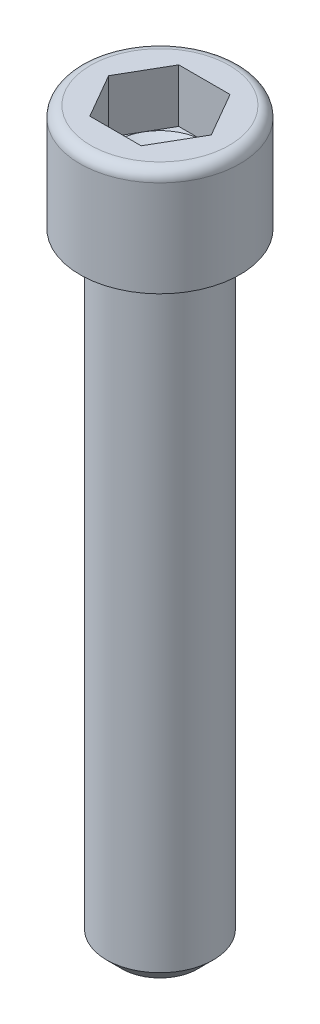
ISO-10303-21;
HEADER;
FILE_DESCRIPTION(('STEP AP214'),'2;1');
FILE_NAME('part.step','',(''),(''),'','','');
FILE_SCHEMA(('AUTOMOTIVE_DESIGN { 1 0 10303 214 1 1 1 1 }'));
ENDSEC;
DATA;
#1=APPLICATION_CONTEXT('core data for automotive mechanical design processes');
#2=APPLICATION_PROTOCOL_DEFINITION('international standard','automotive_design',2000,#1);
#3=PRODUCT_CONTEXT('',#1,'mechanical');
#4=PRODUCT('Part','Part','',(#3));
#5=PRODUCT_RELATED_PRODUCT_CATEGORY('part','',(#4));
#6=PRODUCT_DEFINITION_FORMATION('','',#4);
#7=PRODUCT_DEFINITION_CONTEXT('part definition',#1,'design');
#8=PRODUCT_DEFINITION('design','',#6,#7);
#9=PRODUCT_DEFINITION_SHAPE('','',#8);
#10=(LENGTH_UNIT() NAMED_UNIT(*) SI_UNIT(.MILLI.,.METRE.));
#11=(NAMED_UNIT(*) PLANE_ANGLE_UNIT() SI_UNIT($,.RADIAN.));
#12=(NAMED_UNIT(*) SI_UNIT($,.STERADIAN.) SOLID_ANGLE_UNIT());
#13=UNCERTAINTY_MEASURE_WITH_UNIT(LENGTH_MEASURE(1.E-05),#10,'distance_accuracy_value','');
#14=(GEOMETRIC_REPRESENTATION_CONTEXT(3) GLOBAL_UNCERTAINTY_ASSIGNED_CONTEXT((#13)) GLOBAL_UNIT_ASSIGNED_CONTEXT((#10,
#11,#12)) REPRESENTATION_CONTEXT('',''));
#15=CARTESIAN_POINT('',(0.,0.,0.));
#16=DIRECTION('',(0.,0.,1.));
#17=DIRECTION('',(1.,0.,0.));
#18=AXIS2_PLACEMENT_3D('',#15,#16,#17);
#19=CARTESIAN_POINT('',(5.,12.,0.));
#20=DIRECTION('',(0.,-1.,0.));
#21=DIRECTION('',(1.,0.,0.));
#22=AXIS2_PLACEMENT_3D('',#19,#20,#21);
#23=PLANE('',#22);
#24=CARTESIAN_POINT('',(0.,12.,0.));
#25=DIRECTION('',(0.,1.,0.));
#26=DIRECTION('',(-1.,0.,0.));
#27=AXIS2_PLACEMENT_3D('',#24,#25,#26);
#28=CIRCLE('',#27,7.8);
#29=CARTESIAN_POINT('',(-7.8,12.,0.));
#30=VERTEX_POINT('',#29);
#31=EDGE_CURVE('E141',#30,#30,#28,.T.);
#32=ORIENTED_EDGE('',*,*,#31,.T.);
#33=EDGE_LOOP('',(#32));
#34=FACE_BOUND('',#33,.T.);
#35=DIRECTION('',(0.499999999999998,0.,0.86602540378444));
#36=VECTOR('',#35,1.);
#37=CARTESIAN_POINT('',(2.88675134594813,12.,-5.));
#38=LINE('',#37,#36);
#39=CARTESIAN_POINT('',(2.88675134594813,12.,-5.));
#40=VERTEX_POINT('',#39);
#41=CARTESIAN_POINT('',(5.77350269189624,12.,0.));
#42=VERTEX_POINT('',#41);
#43=EDGE_CURVE('E373',#40,#42,#38,.T.);
#44=ORIENTED_EDGE('',*,*,#43,.T.);
#45=DIRECTION('',(-0.499999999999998,0.,0.86602540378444));
#46=VECTOR('',#45,1.);
#47=CARTESIAN_POINT('',(2.88675134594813,12.,5.));
#48=LINE('',#47,#46);
#49=CARTESIAN_POINT('',(2.88675134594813,12.,5.));
#50=VERTEX_POINT('',#49);
#51=EDGE_CURVE('E376',#42,#50,#48,.T.);
#52=ORIENTED_EDGE('',*,*,#51,.T.);
#53=DIRECTION('',(-1.,0.,0.));
#54=VECTOR('',#53,1.);
#55=CARTESIAN_POINT('',(2.88675134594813,12.,5.));
#56=LINE('',#55,#54);
#57=CARTESIAN_POINT('',(-2.88675134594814,12.,5.));
#58=VERTEX_POINT('',#57);
#59=EDGE_CURVE('E379',#50,#58,#56,.T.);
#60=ORIENTED_EDGE('',*,*,#59,.T.);
#61=DIRECTION('',(-0.499999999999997,0.,-0.86602540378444));
#62=VECTOR('',#61,1.);
#63=CARTESIAN_POINT('',(-2.88675134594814,12.,5.));
#64=LINE('',#63,#62);
#65=CARTESIAN_POINT('',(-5.77350269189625,12.,0.));
#66=VERTEX_POINT('',#65);
#67=EDGE_CURVE('E118',#58,#66,#64,.T.);
#68=ORIENTED_EDGE('',*,*,#67,.T.);
#69=DIRECTION('',(0.499999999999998,0.,-0.86602540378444));
#70=VECTOR('',#69,1.);
#71=CARTESIAN_POINT('',(-2.88675134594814,12.,-5.));
#72=LINE('',#71,#70);
#73=CARTESIAN_POINT('',(-2.88675134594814,12.,-5.));
#74=VERTEX_POINT('',#73);
#75=EDGE_CURVE('E370',#66,#74,#72,.T.);
#76=ORIENTED_EDGE('',*,*,#75,.T.);
#77=DIRECTION('',(1.,0.,0.));
#78=VECTOR('',#77,1.);
#79=CARTESIAN_POINT('',(2.88675134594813,12.,-5.));
#80=LINE('',#79,#78);
#81=EDGE_CURVE('E129',#74,#40,#80,.T.);
#82=ORIENTED_EDGE('',*,*,#81,.T.);
#83=EDGE_LOOP('',(#44,#52,#60,#68,#76,#82));
#84=FACE_BOUND('',#83,.T.);
#85=ADVANCED_FACE('F35',(#34,#84),#23,.F.);
#86=CARTESIAN_POINT('',(0.,-70.,0.));
#87=DIRECTION('',(0.,1.,0.));
#88=DIRECTION('',(0.,0.,1.));
#89=AXIS2_PLACEMENT_3D('',#86,#87,#88);
#90=CYLINDRICAL_SURFACE('',#89,6.);
#91=CARTESIAN_POINT('',(0.,-68.25,0.));
#92=DIRECTION('',(0.,1.,0.));
#93=DIRECTION('',(0.,0.,1.));
#94=AXIS2_PLACEMENT_3D('',#91,#92,#93);
#95=CIRCLE('',#94,6.);
#96=CARTESIAN_POINT('',(0.,-68.25,5.99999999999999));
#97=VERTEX_POINT('',#96);
#98=EDGE_CURVE('E43',#97,#97,#95,.T.);
#99=ORIENTED_EDGE('',*,*,#98,.T.);
#100=EDGE_LOOP('',(#99));
#101=FACE_BOUND('',#100,.T.);
#102=CARTESIAN_POINT('',(0.,0.,0.));
#103=DIRECTION('',(0.,1.,0.));
#104=DIRECTION('',(0.,0.,1.));
#105=AXIS2_PLACEMENT_3D('',#102,#103,#104);
#106=CIRCLE('',#105,6.);
#107=CARTESIAN_POINT('',(0.,0.,6.));
#108=VERTEX_POINT('',#107);
#109=EDGE_CURVE('E151',#108,#108,#106,.T.);
#110=ORIENTED_EDGE('',*,*,#109,.F.);
#111=EDGE_LOOP('',(#110));
#112=FACE_BOUND('',#111,.T.);
#113=ADVANCED_FACE('F156',(#101,#112),#90,.T.);
#114=CARTESIAN_POINT('',(0.,-70.,0.));
#115=DIRECTION('',(0.,1.,0.));
#116=DIRECTION('',(0.,0.,1.));
#117=AXIS2_PLACEMENT_3D('',#114,#115,#116);
#118=PLANE('',#117);
#119=CARTESIAN_POINT('',(0.,-70.,0.));
#120=DIRECTION('',(0.,1.,0.));
#121=DIRECTION('',(0.,0.,1.));
#122=AXIS2_PLACEMENT_3D('',#119,#120,#121);
#123=CIRCLE('',#122,4.25);
#124=CARTESIAN_POINT('',(0.,-70.,4.24999999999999));
#125=VERTEX_POINT('',#124);
#126=EDGE_CURVE('E11',#125,#125,#123,.F.);
#127=ORIENTED_EDGE('',*,*,#126,.T.);
#128=EDGE_LOOP('',(#127));
#129=FACE_BOUND('',#128,.T.);
#130=ADVANCED_FACE('F161',(#129),#118,.F.);
#131=CARTESIAN_POINT('',(0.,-68.25,0.));
#132=DIRECTION('',(0.,1.,0.));
#133=DIRECTION('',(0.,0.,1.));
#134=AXIS2_PLACEMENT_3D('',#131,#132,#133);
#135=CONICAL_SURFACE('',#134,6.,0.785398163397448);
#136=CARTESIAN_POINT('',(0.,-70.,4.24999999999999));
#137=CARTESIAN_POINT('',(0.,-69.9817708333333,4.26822916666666));
#138=CARTESIAN_POINT('',(0.,-69.9635416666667,4.28645833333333));
#139=CARTESIAN_POINT('',(0.,-69.9270833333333,4.32291666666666));
#140=CARTESIAN_POINT('',(0.,-69.9088541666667,4.34114583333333));
#141=CARTESIAN_POINT('',(0.,-69.8723958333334,4.37760416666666));
#142=CARTESIAN_POINT('',(0.,-69.8541666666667,4.39583333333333));
#143=CARTESIAN_POINT('',(0.,-69.8177083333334,4.43229166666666));
#144=CARTESIAN_POINT('',(0.,-69.7994791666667,4.45052083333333));
#145=CARTESIAN_POINT('',(0.,-69.7630208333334,4.48697916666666));
#146=CARTESIAN_POINT('',(0.,-69.7447916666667,4.50520833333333));
#147=CARTESIAN_POINT('',(0.,-69.7083333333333,4.54166666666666));
#148=CARTESIAN_POINT('',(0.,-69.6901041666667,4.55989583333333));
#149=CARTESIAN_POINT('',(0.,-69.6536458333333,4.59635416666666));
#150=CARTESIAN_POINT('',(0.,-69.6354166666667,4.61458333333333));
#151=CARTESIAN_POINT('',(0.,-69.5989583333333,4.65104166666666));
#152=CARTESIAN_POINT('',(0.,-69.5807291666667,4.66927083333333));
#153=CARTESIAN_POINT('',(0.,-69.5442708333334,4.70572916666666));
#154=CARTESIAN_POINT('',(0.,-69.5260416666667,4.72395833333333));
#155=CARTESIAN_POINT('',(0.,-69.4895833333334,4.76041666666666));
#156=CARTESIAN_POINT('',(0.,-69.4713541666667,4.77864583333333));
#157=CARTESIAN_POINT('',(0.,-69.4348958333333,4.81510416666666));
#158=CARTESIAN_POINT('',(0.,-69.4166666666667,4.83333333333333));
#159=CARTESIAN_POINT('',(0.,-69.3802083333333,4.86979166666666));
#160=CARTESIAN_POINT('',(0.,-69.3619791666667,4.88802083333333));
#161=CARTESIAN_POINT('',(0.,-69.3255208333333,4.92447916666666));
#162=CARTESIAN_POINT('',(0.,-69.3072916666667,4.94270833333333));
#163=CARTESIAN_POINT('',(0.,-69.2708333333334,4.97916666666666));
#164=CARTESIAN_POINT('',(0.,-69.2526041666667,4.99739583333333));
#165=CARTESIAN_POINT('',(0.,-69.2161458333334,5.03385416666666));
#166=CARTESIAN_POINT('',(0.,-69.1979166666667,5.05208333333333));
#167=CARTESIAN_POINT('',(0.,-69.1614583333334,5.08854166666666));
#168=CARTESIAN_POINT('',(0.,-69.1432291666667,5.10677083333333));
#169=CARTESIAN_POINT('',(0.,-69.1067708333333,5.14322916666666));
#170=CARTESIAN_POINT('',(0.,-69.0885416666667,5.16145833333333));
#171=CARTESIAN_POINT('',(0.,-69.0520833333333,5.19791666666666));
#172=CARTESIAN_POINT('',(0.,-69.0338541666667,5.21614583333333));
#173=CARTESIAN_POINT('',(0.,-68.9973958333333,5.25260416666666));
#174=CARTESIAN_POINT('',(0.,-68.9791666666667,5.27083333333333));
#175=CARTESIAN_POINT('',(0.,-68.9427083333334,5.30729166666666));
#176=CARTESIAN_POINT('',(0.,-68.9244791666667,5.32552083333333));
#177=CARTESIAN_POINT('',(0.,-68.8880208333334,5.36197916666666));
#178=CARTESIAN_POINT('',(0.,-68.8697916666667,5.38020833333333));
#179=CARTESIAN_POINT('',(0.,-68.8333333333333,5.41666666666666));
#180=CARTESIAN_POINT('',(0.,-68.8151041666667,5.43489583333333));
#181=CARTESIAN_POINT('',(0.,-68.7786458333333,5.47135416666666));
#182=CARTESIAN_POINT('',(0.,-68.7604166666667,5.48958333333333));
#183=CARTESIAN_POINT('',(0.,-68.7239583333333,5.52604166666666));
#184=CARTESIAN_POINT('',(0.,-68.7057291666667,5.54427083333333));
#185=CARTESIAN_POINT('',(0.,-68.6692708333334,5.58072916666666));
#186=CARTESIAN_POINT('',(0.,-68.6510416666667,5.59895833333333));
#187=CARTESIAN_POINT('',(0.,-68.6145833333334,5.63541666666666));
#188=CARTESIAN_POINT('',(0.,-68.5963541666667,5.65364583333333));
#189=CARTESIAN_POINT('',(0.,-68.5598958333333,5.69010416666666));
#190=CARTESIAN_POINT('',(0.,-68.5416666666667,5.70833333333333));
#191=CARTESIAN_POINT('',(0.,-68.5052083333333,5.74479166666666));
#192=CARTESIAN_POINT('',(0.,-68.4869791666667,5.76302083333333));
#193=CARTESIAN_POINT('',(0.,-68.4505208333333,5.79947916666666));
#194=CARTESIAN_POINT('',(0.,-68.4322916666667,5.81770833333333));
#195=CARTESIAN_POINT('',(0.,-68.3958333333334,5.85416666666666));
#196=CARTESIAN_POINT('',(0.,-68.3776041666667,5.87239583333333));
#197=CARTESIAN_POINT('',(0.,-68.3411458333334,5.90885416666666));
#198=CARTESIAN_POINT('',(0.,-68.3229166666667,5.92708333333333));
#199=CARTESIAN_POINT('',(0.,-68.2864583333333,5.96354166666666));
#200=CARTESIAN_POINT('',(0.,-68.2682291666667,5.98177083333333));
#201=CARTESIAN_POINT('',(0.,-68.25,5.99999999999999));
#202=B_SPLINE_CURVE_WITH_KNOTS('',3,(#136,#137,#138,#139,#140,#141,#142,#143,#144,#145,#146,
#147,#148,#149,#150,#151,#152,#153,#154,#155,#156,#157,#158,#159,#160,#161,#162,#163,#164,#165,
#166,#167,#168,#169,#170,#171,#172,#173,#174,#175,#176,#177,#178,#179,#180,#181,#182,#183,#184,
#185,#186,#187,#188,#189,#190,#191,#192,#193,#194,#195,#196,#197,#198,#199,#200,#201),
.UNSPECIFIED.,.F.,.F.,(4,2,2,2,2,2,2,2,2,2,2,2,2,2,2,2,2,2,2,2,2,2,2,2,2,2,2,2,2,2,2,2,4),(0.,
0.0773398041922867,0.154679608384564,0.23201941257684,0.309359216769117,0.386699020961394,
0.464038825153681,0.541378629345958,0.618718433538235,0.696058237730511,0.773398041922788,
0.850737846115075,0.928077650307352,1.00541745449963,1.08275725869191,1.16009706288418,
1.23743686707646,1.31477667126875,1.39211647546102,1.4694562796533,1.54679608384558,
1.62413588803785,1.70147569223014,1.77881549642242,1.85615530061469,1.93349510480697,
2.01083490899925,2.08817471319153,2.16551451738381,2.24285432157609,2.32019412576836,
2.39753392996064,2.47487373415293),.UNSPECIFIED.);
#203=EDGE_CURVE('BSEAM37',#125,#97,#202,.T.);
#204=ORIENTED_EDGE('',*,*,#126,.F.);
#205=ORIENTED_EDGE('',*,*,#98,.F.);
#206=ORIENTED_EDGE('',*,*,#203,.T.);
#207=ORIENTED_EDGE('',*,*,#203,.F.);
#208=EDGE_LOOP('',(#204,#206,#205,#207));
#209=FACE_BOUND('',#208,.T.);
#210=ADVANCED_FACE('F37',(#209),#135,.T.);
#211=CARTESIAN_POINT('',(0.,0.,0.));
#212=DIRECTION('',(0.,1.,0.));
#213=DIRECTION('',(-1.,0.,0.));
#214=AXIS2_PLACEMENT_3D('',#211,#212,#213);
#215=PLANE('',#214);
#216=ORIENTED_EDGE('',*,*,#109,.T.);
#217=EDGE_LOOP('',(#216));
#218=FACE_BOUND('',#217,.T.);
#219=CARTESIAN_POINT('',(0.,0.,0.));
#220=DIRECTION('',(0.,1.,0.));
#221=DIRECTION('',(-1.,0.,0.));
#222=AXIS2_PLACEMENT_3D('',#219,#220,#221);
#223=CIRCLE('',#222,9.);
#224=CARTESIAN_POINT('',(-9.,0.,0.));
#225=VERTEX_POINT('',#224);
#226=EDGE_CURVE('E148',#225,#225,#223,.T.);
#227=ORIENTED_EDGE('',*,*,#226,.F.);
#228=EDGE_LOOP('',(#227));
#229=FACE_BOUND('',#228,.T.);
#230=ADVANCED_FACE('F160',(#218,#229),#215,.F.);
#231=CARTESIAN_POINT('',(0.,12.,0.));
#232=DIRECTION('',(0.,1.,0.));
#233=DIRECTION('',(-1.,0.,0.));
#234=AXIS2_PLACEMENT_3D('',#231,#232,#233);
#235=CYLINDRICAL_SURFACE('',#234,9.);
#236=CARTESIAN_POINT('',(0.,10.8,0.));
#237=DIRECTION('',(0.,1.,0.));
#238=DIRECTION('',(-1.,0.,0.));
#239=AXIS2_PLACEMENT_3D('',#236,#237,#238);
#240=CIRCLE('',#239,9.);
#241=CARTESIAN_POINT('',(-9.,10.8,0.));
#242=VERTEX_POINT('',#241);
#243=EDGE_CURVE('E145',#242,#242,#240,.T.);
#244=ORIENTED_EDGE('',*,*,#243,.F.);
#245=EDGE_LOOP('',(#244));
#246=FACE_BOUND('',#245,.T.);
#247=ORIENTED_EDGE('',*,*,#226,.T.);
#248=EDGE_LOOP('',(#247));
#249=FACE_BOUND('',#248,.T.);
#250=ADVANCED_FACE('F167',(#246,#249),#235,.T.);
#251=CARTESIAN_POINT('',(0.,10.8,0.));
#252=DIRECTION('',(0.,1.,0.));
#253=DIRECTION('',(-1.,0.,0.));
#254=AXIS2_PLACEMENT_3D('',#251,#252,#253);
#255=TOROIDAL_SURFACE('',#254,7.8,1.2);
#256=ORIENTED_EDGE('',*,*,#31,.F.);
#257=EDGE_LOOP('',(#256));
#258=FACE_BOUND('',#257,.T.);
#259=ORIENTED_EDGE('',*,*,#243,.T.);
#260=EDGE_LOOP('',(#259));
#261=FACE_BOUND('',#260,.T.);
#262=ADVANCED_FACE('F184',(#258,#261),#255,.T.);
#263=CARTESIAN_POINT('',(-2.88675134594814,6.,-5.));
#264=DIRECTION('',(0.86602540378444,0.,0.499999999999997));
#265=DIRECTION('',(0.499999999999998,0.,-0.86602540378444));
#266=AXIS2_PLACEMENT_3D('',#263,#264,#265);
#267=PLANE('',#266);
#268=ORIENTED_EDGE('',*,*,#75,.F.);
#269=DIRECTION('',(0.,1.,0.));
#270=VECTOR('',#269,1.);
#271=CARTESIAN_POINT('',(-5.77350269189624,6.,0.));
#272=LINE('',#271,#270);
#273=CARTESIAN_POINT('',(-5.77350269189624,6.,0.));
#274=VERTEX_POINT('',#273);
#275=EDGE_CURVE('E365',#274,#66,#272,.T.);
#276=ORIENTED_EDGE('',*,*,#275,.F.);
#277=DIRECTION('',(0.499999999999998,0.,-0.86602540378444));
#278=VECTOR('',#277,1.);
#279=CARTESIAN_POINT('',(-2.88675134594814,6.,-5.));
#280=LINE('',#279,#278);
#281=CARTESIAN_POINT('',(-4.3301270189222,6.,-2.49999999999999));
#282=VERTEX_POINT('',#281);
#283=EDGE_CURVE('E114',#274,#282,#280,.T.);
#284=ORIENTED_EDGE('',*,*,#283,.T.);
#285=CARTESIAN_POINT('',(-2.88675134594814,6.,-5.));
#286=VERTEX_POINT('',#285);
#287=EDGE_CURVE('E108',#282,#286,#280,.T.);
#288=ORIENTED_EDGE('',*,*,#287,.T.);
#289=DIRECTION('',(0.,1.,0.));
#290=VECTOR('',#289,1.);
#291=CARTESIAN_POINT('',(-2.88675134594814,6.,-5.));
#292=LINE('',#291,#290);
#293=EDGE_CURVE('E110',#286,#74,#292,.T.);
#294=ORIENTED_EDGE('',*,*,#293,.T.);
#295=EDGE_LOOP('',(#268,#276,#284,#288,#294));
#296=FACE_BOUND('',#295,.T.);
#297=ADVANCED_FACE('F109',(#296),#267,.T.);
#298=CARTESIAN_POINT('',(2.88675134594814,6.,-5.));
#299=DIRECTION('',(0.,0.,1.));
#300=DIRECTION('',(1.,0.,0.));
#301=AXIS2_PLACEMENT_3D('',#298,#299,#300);
#302=PLANE('',#301);
#303=ORIENTED_EDGE('',*,*,#81,.F.);
#304=ORIENTED_EDGE('',*,*,#293,.F.);
#305=DIRECTION('',(1.,0.,0.));
#306=VECTOR('',#305,1.);
#307=CARTESIAN_POINT('',(2.88675134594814,6.,-5.));
#308=LINE('',#307,#306);
#309=CARTESIAN_POINT('',(0.,6.,-5.));
#310=VERTEX_POINT('',#309);
#311=EDGE_CURVE('E50',#286,#310,#308,.T.);
#312=ORIENTED_EDGE('',*,*,#311,.T.);
#313=CARTESIAN_POINT('',(2.88675134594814,6.,-5.));
#314=VERTEX_POINT('',#313);
#315=EDGE_CURVE('E124',#310,#314,#308,.T.);
#316=ORIENTED_EDGE('',*,*,#315,.T.);
#317=DIRECTION('',(0.,1.,0.));
#318=VECTOR('',#317,1.);
#319=CARTESIAN_POINT('',(2.88675134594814,6.,-5.));
#320=LINE('',#319,#318);
#321=EDGE_CURVE('E131',#314,#40,#320,.T.);
#322=ORIENTED_EDGE('',*,*,#321,.T.);
#323=EDGE_LOOP('',(#303,#304,#312,#316,#322));
#324=FACE_BOUND('',#323,.T.);
#325=ADVANCED_FACE('F126',(#324),#302,.T.);
#326=CARTESIAN_POINT('',(2.88675134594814,6.,-5.));
#327=DIRECTION('',(-0.86602540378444,0.,0.499999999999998));
#328=DIRECTION('',(0.499999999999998,0.,0.86602540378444));
#329=AXIS2_PLACEMENT_3D('',#326,#327,#328);
#330=PLANE('',#329);
#331=ORIENTED_EDGE('',*,*,#43,.F.);
#332=ORIENTED_EDGE('',*,*,#321,.F.);
#333=DIRECTION('',(0.499999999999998,0.,0.86602540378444));
#334=VECTOR('',#333,1.);
#335=CARTESIAN_POINT('',(2.88675134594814,6.,-5.));
#336=LINE('',#335,#334);
#337=CARTESIAN_POINT('',(4.3301270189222,6.,-2.49999999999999));
#338=VERTEX_POINT('',#337);
#339=EDGE_CURVE('E398',#314,#338,#336,.T.);
#340=ORIENTED_EDGE('',*,*,#339,.T.);
#341=CARTESIAN_POINT('',(5.77350269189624,6.,0.));
#342=VERTEX_POINT('',#341);
#343=EDGE_CURVE('E123',#338,#342,#336,.T.);
#344=ORIENTED_EDGE('',*,*,#343,.T.);
#345=DIRECTION('',(0.,1.,0.));
#346=VECTOR('',#345,1.);
#347=CARTESIAN_POINT('',(5.77350269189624,6.,0.));
#348=LINE('',#347,#346);
#349=EDGE_CURVE('E136',#342,#42,#348,.T.);
#350=ORIENTED_EDGE('',*,*,#349,.T.);
#351=EDGE_LOOP('',(#331,#332,#340,#344,#350));
#352=FACE_BOUND('',#351,.T.);
#353=ADVANCED_FACE('F214',(#352),#330,.T.);
#354=CARTESIAN_POINT('',(2.88675134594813,6.,5.));
#355=DIRECTION('',(-0.86602540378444,0.,-0.499999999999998));
#356=DIRECTION('',(-0.499999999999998,0.,0.86602540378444));
#357=AXIS2_PLACEMENT_3D('',#354,#355,#356);
#358=PLANE('',#357);
#359=ORIENTED_EDGE('',*,*,#51,.F.);
#360=ORIENTED_EDGE('',*,*,#349,.F.);
#361=DIRECTION('',(-0.499999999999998,0.,0.86602540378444));
#362=VECTOR('',#361,1.);
#363=CARTESIAN_POINT('',(2.88675134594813,6.,5.));
#364=LINE('',#363,#362);
#365=CARTESIAN_POINT('',(4.3301270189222,6.,2.49999999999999));
#366=VERTEX_POINT('',#365);
#367=EDGE_CURVE('E396',#342,#366,#364,.T.);
#368=ORIENTED_EDGE('',*,*,#367,.T.);
#369=CARTESIAN_POINT('',(2.88675134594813,6.,5.));
#370=VERTEX_POINT('',#369);
#371=EDGE_CURVE('E397',#366,#370,#364,.T.);
#372=ORIENTED_EDGE('',*,*,#371,.T.);
#373=DIRECTION('',(0.,1.,0.));
#374=VECTOR('',#373,1.);
#375=CARTESIAN_POINT('',(2.88675134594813,6.,5.));
#376=LINE('',#375,#374);
#377=EDGE_CURVE('E385',#370,#50,#376,.T.);
#378=ORIENTED_EDGE('',*,*,#377,.T.);
#379=EDGE_LOOP('',(#359,#360,#368,#372,#378));
#380=FACE_BOUND('',#379,.T.);
#381=ADVANCED_FACE('F221',(#380),#358,.T.);
#382=CARTESIAN_POINT('',(2.88675134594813,6.,5.));
#383=DIRECTION('',(0.,0.,-1.));
#384=DIRECTION('',(-1.,0.,0.));
#385=AXIS2_PLACEMENT_3D('',#382,#383,#384);
#386=PLANE('',#385);
#387=ORIENTED_EDGE('',*,*,#59,.F.);
#388=ORIENTED_EDGE('',*,*,#377,.F.);
#389=DIRECTION('',(-1.,0.,0.));
#390=VECTOR('',#389,1.);
#391=CARTESIAN_POINT('',(2.88675134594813,6.,5.));
#392=LINE('',#391,#390);
#393=CARTESIAN_POINT('',(0.,6.,5.));
#394=VERTEX_POINT('',#393);
#395=EDGE_CURVE('E360',#370,#394,#392,.T.);
#396=ORIENTED_EDGE('',*,*,#395,.T.);
#397=CARTESIAN_POINT('',(-2.88675134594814,6.,5.));
#398=VERTEX_POINT('',#397);
#399=EDGE_CURVE('E356',#394,#398,#392,.T.);
#400=ORIENTED_EDGE('',*,*,#399,.T.);
#401=DIRECTION('',(0.,1.,0.));
#402=VECTOR('',#401,1.);
#403=CARTESIAN_POINT('',(-2.88675134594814,6.,5.));
#404=LINE('',#403,#402);
#405=EDGE_CURVE('E364',#398,#58,#404,.T.);
#406=ORIENTED_EDGE('',*,*,#405,.T.);
#407=EDGE_LOOP('',(#387,#388,#396,#400,#406));
#408=FACE_BOUND('',#407,.T.);
#409=ADVANCED_FACE('F229',(#408),#386,.T.);
#410=CARTESIAN_POINT('',(-2.88675134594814,6.,5.));
#411=DIRECTION('',(0.86602540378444,0.,-0.499999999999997));
#412=DIRECTION('',(-0.499999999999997,0.,-0.86602540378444));
#413=AXIS2_PLACEMENT_3D('',#410,#411,#412);
#414=PLANE('',#413);
#415=ORIENTED_EDGE('',*,*,#67,.F.);
#416=ORIENTED_EDGE('',*,*,#405,.F.);
#417=DIRECTION('',(-0.499999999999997,0.,-0.86602540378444));
#418=VECTOR('',#417,1.);
#419=CARTESIAN_POINT('',(-2.88675134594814,6.,5.));
#420=LINE('',#419,#418);
#421=CARTESIAN_POINT('',(-4.3301270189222,6.,2.49999999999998));
#422=VERTEX_POINT('',#421);
#423=EDGE_CURVE('E355',#398,#422,#420,.T.);
#424=ORIENTED_EDGE('',*,*,#423,.T.);
#425=EDGE_CURVE('E358',#422,#274,#420,.T.);
#426=ORIENTED_EDGE('',*,*,#425,.T.);
#427=ORIENTED_EDGE('',*,*,#275,.T.);
#428=EDGE_LOOP('',(#415,#416,#424,#426,#427));
#429=FACE_BOUND('',#428,.T.);
#430=ADVANCED_FACE('F237',(#429),#414,.T.);
#431=CARTESIAN_POINT('',(-8.66025403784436,6.,5.));
#432=DIRECTION('',(0.,-1.,0.));
#433=DIRECTION('',(0.,0.,-1.));
#434=AXIS2_PLACEMENT_3D('',#431,#432,#433);
#435=PLANE('',#434);
#436=ORIENTED_EDGE('',*,*,#311,.F.);
#437=ORIENTED_EDGE('',*,*,#287,.F.);
#438=CARTESIAN_POINT('',(0.,6.,0.));
#439=DIRECTION('',(0.,1.,0.));
#440=DIRECTION('',(-1.,0.,0.));
#441=AXIS2_PLACEMENT_3D('',#438,#439,#440);
#442=CIRCLE('',#441,5.);
#443=EDGE_CURVE('E121',#310,#282,#442,.T.);
#444=ORIENTED_EDGE('',*,*,#443,.F.);
#445=EDGE_LOOP('',(#436,#437,#444));
#446=FACE_BOUND('',#445,.T.);
#447=ADVANCED_FACE('F120',(#446),#435,.F.);
#448=ORIENTED_EDGE('',*,*,#283,.F.);
#449=ORIENTED_EDGE('',*,*,#425,.F.);
#450=EDGE_CURVE('E130',#282,#422,#442,.T.);
#451=ORIENTED_EDGE('',*,*,#450,.F.);
#452=EDGE_LOOP('',(#448,#449,#451));
#453=FACE_BOUND('',#452,.T.);
#454=ADVANCED_FACE('F252',(#453),#435,.F.);
#455=ORIENTED_EDGE('',*,*,#423,.F.);
#456=ORIENTED_EDGE('',*,*,#399,.F.);
#457=EDGE_CURVE('E135',#422,#394,#442,.T.);
#458=ORIENTED_EDGE('',*,*,#457,.F.);
#459=EDGE_LOOP('',(#455,#456,#458));
#460=FACE_BOUND('',#459,.T.);
#461=ADVANCED_FACE('F260',(#460),#435,.F.);
#462=ORIENTED_EDGE('',*,*,#395,.F.);
#463=ORIENTED_EDGE('',*,*,#371,.F.);
#464=EDGE_CURVE('E142',#394,#366,#442,.T.);
#465=ORIENTED_EDGE('',*,*,#464,.F.);
#466=EDGE_LOOP('',(#462,#463,#465));
#467=FACE_BOUND('',#466,.T.);
#468=ADVANCED_FACE('F267',(#467),#435,.F.);
#469=ORIENTED_EDGE('',*,*,#367,.F.);
#470=ORIENTED_EDGE('',*,*,#343,.F.);
#471=EDGE_CURVE('E402',#366,#338,#442,.T.);
#472=ORIENTED_EDGE('',*,*,#471,.F.);
#473=EDGE_LOOP('',(#469,#470,#472));
#474=FACE_BOUND('',#473,.T.);
#475=ADVANCED_FACE('F274',(#474),#435,.F.);
#476=ORIENTED_EDGE('',*,*,#339,.F.);
#477=ORIENTED_EDGE('',*,*,#315,.F.);
#478=EDGE_CURVE('E401',#338,#310,#442,.T.);
#479=ORIENTED_EDGE('',*,*,#478,.F.);
#480=EDGE_LOOP('',(#476,#477,#479));
#481=FACE_BOUND('',#480,.T.);
#482=ADVANCED_FACE('F254',(#481),#435,.F.);
#483=CARTESIAN_POINT('',(0.,6.,0.));
#484=DIRECTION('',(0.,1.,0.));
#485=DIRECTION('',(-1.,0.,0.));
#486=AXIS2_PLACEMENT_3D('',#483,#484,#485);
#487=CONICAL_SURFACE('',#486,5.,1.04719755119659);
#488=CARTESIAN_POINT('',(0.,3.11324865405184,0.));
#489=VERTEX_POINT('',#488);
#490=VERTEX_LOOP('',#489);
#491=FACE_BOUND('',#490,.T.);
#492=ORIENTED_EDGE('',*,*,#457,.T.);
#493=ORIENTED_EDGE('',*,*,#464,.T.);
#494=ORIENTED_EDGE('',*,*,#471,.T.);
#495=ORIENTED_EDGE('',*,*,#478,.T.);
#496=ORIENTED_EDGE('',*,*,#443,.T.);
#497=ORIENTED_EDGE('',*,*,#450,.T.);
#498=EDGE_LOOP('',(#492,#493,#494,#495,#496,#497));
#499=FACE_BOUND('',#498,.T.);
#500=ADVANCED_FACE('F182',(#491,#499),#487,.F.);
#501=CLOSED_SHELL('',(#85,#113,#130,#210,#230,#250,#262,#297,#325,#353,#381,#409,#430,#447,#454,
#461,#468,#475,#482,#500));
#502=MANIFOLD_SOLID_BREP('B2',#501);
#503=ADVANCED_BREP_SHAPE_REPRESENTATION('',(#18,#502),#14);
#504=SHAPE_DEFINITION_REPRESENTATION(#9,#503);
ENDSEC;
END-ISO-10303-21;
